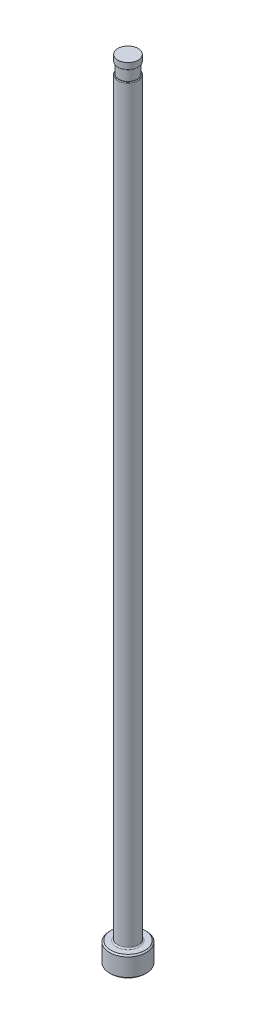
ISO-10303-21;
HEADER;
FILE_DESCRIPTION(('STEP AP214'),'2;1');
FILE_NAME('part.step','',(''),(''),'','','');
FILE_SCHEMA(('AUTOMOTIVE_DESIGN { 1 0 10303 214 1 1 1 1 }'));
ENDSEC;
DATA;
#1=APPLICATION_CONTEXT('core data for automotive mechanical design processes');
#2=APPLICATION_PROTOCOL_DEFINITION('international standard','automotive_design',2000,#1);
#3=PRODUCT_CONTEXT('',#1,'mechanical');
#4=PRODUCT('Part','Part','',(#3));
#5=PRODUCT_RELATED_PRODUCT_CATEGORY('part','',(#4));
#6=PRODUCT_DEFINITION_FORMATION('','',#4);
#7=PRODUCT_DEFINITION_CONTEXT('part definition',#1,'design');
#8=PRODUCT_DEFINITION('design','',#6,#7);
#9=PRODUCT_DEFINITION_SHAPE('','',#8);
#10=(LENGTH_UNIT() NAMED_UNIT(*) SI_UNIT(.MILLI.,.METRE.));
#11=(NAMED_UNIT(*) PLANE_ANGLE_UNIT() SI_UNIT($,.RADIAN.));
#12=(NAMED_UNIT(*) SI_UNIT($,.STERADIAN.) SOLID_ANGLE_UNIT());
#13=UNCERTAINTY_MEASURE_WITH_UNIT(LENGTH_MEASURE(1.E-05),#10,'distance_accuracy_value','');
#14=(GEOMETRIC_REPRESENTATION_CONTEXT(3) GLOBAL_UNCERTAINTY_ASSIGNED_CONTEXT((#13)) GLOBAL_UNIT_ASSIGNED_CONTEXT((#10,
#11,#12)) REPRESENTATION_CONTEXT('',''));
#15=CARTESIAN_POINT('',(0.,0.,0.));
#16=DIRECTION('',(0.,0.,1.));
#17=DIRECTION('',(1.,0.,0.));
#18=AXIS2_PLACEMENT_3D('',#15,#16,#17);
#19=CARTESIAN_POINT('',(-1.98373999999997,151.13,0.));
#20=DIRECTION('',(0.,1.,0.));
#21=DIRECTION('',(0.,0.,1.));
#22=AXIS2_PLACEMENT_3D('',#19,#20,#21);
#23=PLANE('',#22);
#24=CARTESIAN_POINT('',(0.,151.13,0.));
#25=DIRECTION('',(0.,1.,0.));
#26=DIRECTION('',(0.,0.,1.));
#27=AXIS2_PLACEMENT_3D('',#24,#25,#26);
#28=CIRCLE('',#27,1.83768999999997);
#29=CARTESIAN_POINT('',(0.,151.13,1.83768999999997));
#30=VERTEX_POINT('',#29);
#31=EDGE_CURVE('E11',#30,#30,#28,.F.);
#32=ORIENTED_EDGE('',*,*,#31,.T.);
#33=EDGE_LOOP('',(#32));
#34=FACE_BOUND('',#33,.T.);
#35=CARTESIAN_POINT('',(0.,151.13,0.));
#36=DIRECTION('',(0.,1.,0.));
#37=DIRECTION('',(0.,0.,1.));
#38=AXIS2_PLACEMENT_3D('',#35,#36,#37);
#39=CIRCLE('',#38,1.78053999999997);
#40=CARTESIAN_POINT('',(0.,151.13,1.78053999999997));
#41=VERTEX_POINT('',#40);
#42=EDGE_CURVE('E78',#41,#41,#39,.T.);
#43=ORIENTED_EDGE('',*,*,#42,.T.);
#44=EDGE_LOOP('',(#43));
#45=FACE_BOUND('',#44,.T.);
#46=ADVANCED_FACE('F36',(#34,#45),#23,.F.);
#47=CARTESIAN_POINT('',(0.,259.958771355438,0.));
#48=DIRECTION('',(0.,1.,0.));
#49=DIRECTION('',(0.,0.,1.));
#50=AXIS2_PLACEMENT_3D('',#47,#48,#49);
#51=CYLINDRICAL_SURFACE('',#50,1.98373999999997);
#52=DIRECTION('',(0.,1.,0.));
#53=VECTOR('',#52,1.);
#54=CARTESIAN_POINT('',(-1.78053999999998,259.958771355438,-0.87458658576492));
#55=LINE('',#54,#53);
#56=CARTESIAN_POINT('',(-1.78053999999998,148.971,-0.87458658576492));
#57=VERTEX_POINT('',#56);
#58=CARTESIAN_POINT('',(-1.78053999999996,86.614,-0.874586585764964));
#59=VERTEX_POINT('',#58);
#60=EDGE_CURVE('E73',#57,#59,#55,.F.);
#61=ORIENTED_EDGE('',*,*,#60,.F.);
#62=CARTESIAN_POINT('',(0.,148.971,0.));
#63=DIRECTION('',(0.,-1.,0.));
#64=DIRECTION('',(0.,0.,-1.));
#65=AXIS2_PLACEMENT_3D('',#62,#63,#64);
#66=CIRCLE('',#65,1.98373999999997);
#67=CARTESIAN_POINT('',(-1.78053999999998,148.971,0.87458658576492));
#68=VERTEX_POINT('',#67);
#69=EDGE_CURVE('E51',#57,#68,#66,.T.);
#70=ORIENTED_EDGE('',*,*,#69,.T.);
#71=DIRECTION('',(0.,1.,0.));
#72=VECTOR('',#71,1.);
#73=CARTESIAN_POINT('',(-1.78053999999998,259.958771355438,0.87458658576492));
#74=LINE('',#73,#72);
#75=CARTESIAN_POINT('',(-1.78053999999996,86.614,0.874586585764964));
#76=VERTEX_POINT('',#75);
#77=EDGE_CURVE('E84',#76,#68,#74,.T.);
#78=ORIENTED_EDGE('',*,*,#77,.F.);
#79=CARTESIAN_POINT('',(-1.78053999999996,86.614,-0.874586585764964));
#80=CARTESIAN_POINT('',(-1.78053865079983,86.5812968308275,-0.874582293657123));
#81=CARTESIAN_POINT('',(-1.78104579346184,86.5486048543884,-0.873557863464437));
#82=CARTESIAN_POINT('',(-1.78306050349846,86.4833726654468,-0.869440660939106));
#83=CARTESIAN_POINT('',(-1.78456837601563,86.4508325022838,-0.866347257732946));
#84=CARTESIAN_POINT('',(-1.79058935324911,86.3533142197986,-0.853877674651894));
#85=CARTESIAN_POINT('',(-1.7965995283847,86.288794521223,-0.841311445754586));
#86=CARTESIAN_POINT('',(-1.81216655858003,86.162456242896,-0.807234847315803));
#87=CARTESIAN_POINT('',(-1.82173064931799,86.1006434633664,-0.785706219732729));
#88=CARTESIAN_POINT('',(-1.84353272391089,85.9818109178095,-0.733090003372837));
#89=CARTESIAN_POINT('',(-1.85576409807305,85.9247797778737,-0.702025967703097));
#90=CARTESIAN_POINT('',(-1.87864294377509,85.8296691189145,-0.637816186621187));
#91=CARTESIAN_POINT('',(-1.88904107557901,85.7901900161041,-0.606655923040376));
#92=CARTESIAN_POINT('',(-1.9096749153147,85.7169072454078,-0.538182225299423));
#93=CARTESIAN_POINT('',(-1.91991077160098,85.6830980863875,-0.500874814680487));
#94=CARTESIAN_POINT('',(-1.93765949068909,85.6272104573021,-0.426534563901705));
#95=CARTESIAN_POINT('',(-1.94535058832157,85.6041335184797,-0.390297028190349));
#96=CARTESIAN_POINT('',(-1.95906883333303,85.5641265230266,-0.314264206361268));
#97=CARTESIAN_POINT('',(-1.965096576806,85.5471942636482,-0.27447020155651));
#98=CARTESIAN_POINT('',(-1.97485334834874,85.5202257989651,-0.192104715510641));
#99=CARTESIAN_POINT('',(-1.97857112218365,85.5102233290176,-0.149520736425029));
#100=CARTESIAN_POINT('',(-1.98320696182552,85.497797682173,-0.0631103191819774));
#101=CARTESIAN_POINT('',(-1.98412600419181,85.4953718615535,-0.0192843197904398));
#102=CARTESIAN_POINT('',(-1.98310107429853,85.498100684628,0.0642372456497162));
#103=CARTESIAN_POINT('',(-1.98140057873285,85.5026106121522,0.103958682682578));
#104=CARTESIAN_POINT('',(-1.97575922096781,85.5178264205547,0.182020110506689));
#105=CARTESIAN_POINT('',(-1.97181856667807,85.5285317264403,0.220360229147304));
#106=CARTESIAN_POINT('',(-1.96206992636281,85.5557141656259,0.294827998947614));
#107=CARTESIAN_POINT('',(-1.95625507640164,85.5722125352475,0.330946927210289));
#108=CARTESIAN_POINT('',(-1.9432907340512,85.6103152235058,0.400107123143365));
#109=CARTESIAN_POINT('',(-1.93614084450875,85.6319210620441,0.433147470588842));
#110=CARTESIAN_POINT('',(-1.92029960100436,85.6819613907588,0.498934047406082));
#111=CARTESIAN_POINT('',(-1.91152531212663,85.7108706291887,0.531297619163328));
#112=CARTESIAN_POINT('',(-1.89377241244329,85.7730184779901,0.591469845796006));
#113=CARTESIAN_POINT('',(-1.88479370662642,85.8062591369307,0.619276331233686));
#114=CARTESIAN_POINT('',(-1.86569807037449,85.8823604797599,0.674838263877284));
#115=CARTESIAN_POINT('',(-1.85566100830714,85.9258824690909,0.701713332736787));
#116=CARTESIAN_POINT('',(-1.83693898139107,86.0164245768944,0.749356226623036));
#117=CARTESIAN_POINT('',(-1.82825528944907,86.0634479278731,0.770118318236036));
#118=CARTESIAN_POINT('',(-1.8111557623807,86.1701808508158,0.809629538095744));
#119=CARTESIAN_POINT('',(-1.8031876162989,86.2304653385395,0.827017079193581));
#120=CARTESIAN_POINT('',(-1.79067795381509,86.3530954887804,0.853764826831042));
#121=CARTESIAN_POINT('',(-1.78613494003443,86.4154402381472,0.863128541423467));
#122=CARTESIAN_POINT('',(-1.78247943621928,86.5007444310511,0.870628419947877));
#123=CARTESIAN_POINT('',(-1.78175210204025,86.5233874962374,0.872115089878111));
#124=CARTESIAN_POINT('',(-1.78078289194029,86.5686849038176,0.874092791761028));
#125=CARTESIAN_POINT('',(-1.78054010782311,86.5913391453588,0.874585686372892));
#126=CARTESIAN_POINT('',(-1.78053999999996,86.614,0.874586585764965));
#127=B_SPLINE_CURVE_WITH_KNOTS('',3,(#79,#80,#81,#82,#83,#84,#85,#86,#87,#88,#89,#90,#91,#92,
#93,#94,#95,#96,#97,#98,#99,#100,#101,#102,#103,#104,#105,#106,#107,#108,#109,#110,#111,#112,
#113,#114,#115,#116,#117,#118,#119,#120,#121,#122,#123,#124,#125,#126),.UNSPECIFIED.,.F.,.F.,(4,
2,2,2,2,2,2,2,2,2,2,2,2,2,2,2,2,2,2,2,2,2,2,4),(0.,0.098066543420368,0.196163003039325,
0.393415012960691,0.591070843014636,0.78824232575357,0.941736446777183,1.09508104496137,
1.22546509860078,1.35580236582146,1.48676976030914,1.6176914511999,1.73715752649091,
1.85661251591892,1.97651005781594,2.0964433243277,2.22876073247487,2.36114094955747,
2.51695507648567,2.67291488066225,2.86196277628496,3.05092797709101,3.11901829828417,
3.18698087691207),.UNSPECIFIED.);
#128=EDGE_CURVE('E81',#59,#76,#127,.T.);
#129=ORIENTED_EDGE('',*,*,#128,.F.);
#130=EDGE_LOOP('',(#61,#70,#78,#129));
#131=FACE_BOUND('',#130,.T.);
#132=CARTESIAN_POINT('',(0.,4.21640000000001,0.));
#133=DIRECTION('',(0.,1.,0.));
#134=DIRECTION('',(0.,0.,1.));
#135=AXIS2_PLACEMENT_3D('',#132,#133,#134);
#136=CIRCLE('',#135,1.98373999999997);
#137=CARTESIAN_POINT('',(0.,4.21640000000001,1.98373999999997));
#138=VERTEX_POINT('',#137);
#139=EDGE_CURVE('E116',#138,#138,#136,.T.);
#140=ORIENTED_EDGE('',*,*,#139,.T.);
#141=EDGE_LOOP('',(#140));
#142=FACE_BOUND('',#141,.T.);
#143=ADVANCED_FACE('F82',(#131,#142),#51,.T.);
#144=CARTESIAN_POINT('',(0.,0.,0.));
#145=DIRECTION('',(0.,-1.,0.));
#146=DIRECTION('',(0.,0.,-1.));
#147=AXIS2_PLACEMENT_3D('',#144,#145,#146);
#148=PLANE('',#147);
#149=CARTESIAN_POINT('',(0.,0.,0.));
#150=DIRECTION('',(0.,-1.,0.));
#151=DIRECTION('',(0.,0.,-1.));
#152=AXIS2_PLACEMENT_3D('',#149,#150,#151);
#153=CIRCLE('',#152,3.31469999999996);
#154=CARTESIAN_POINT('',(0.,0.,-3.31469999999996));
#155=VERTEX_POINT('',#154);
#156=EDGE_CURVE('E113',#155,#155,#153,.T.);
#157=ORIENTED_EDGE('',*,*,#156,.T.);
#158=EDGE_LOOP('',(#157));
#159=FACE_BOUND('',#158,.T.);
#160=ADVANCED_FACE('F192',(#159),#148,.T.);
#161=CARTESIAN_POINT('',(0.,259.958771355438,0.));
#162=DIRECTION('',(0.,1.,0.));
#163=DIRECTION('',(0.,0.,1.));
#164=AXIS2_PLACEMENT_3D('',#161,#162,#163);
#165=CYLINDRICAL_SURFACE('',#164,3.56869999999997);
#166=CARTESIAN_POINT('',(0.,3.70839999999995,0.));
#167=DIRECTION('',(0.,1.,0.));
#168=DIRECTION('',(0.,0.,1.));
#169=AXIS2_PLACEMENT_3D('',#166,#167,#168);
#170=CIRCLE('',#169,3.56869999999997);
#171=CARTESIAN_POINT('',(0.,3.70839999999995,3.56869999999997));
#172=VERTEX_POINT('',#171);
#173=EDGE_CURVE('E110',#172,#172,#170,.F.);
#174=ORIENTED_EDGE('',*,*,#173,.T.);
#175=EDGE_LOOP('',(#174));
#176=FACE_BOUND('',#175,.T.);
#177=CARTESIAN_POINT('',(0.,0.254000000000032,0.));
#178=DIRECTION('',(0.,-1.,0.));
#179=DIRECTION('',(0.,0.,-1.));
#180=AXIS2_PLACEMENT_3D('',#177,#178,#179);
#181=CIRCLE('',#180,3.56869999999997);
#182=CARTESIAN_POINT('',(0.,0.254000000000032,-3.56869999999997));
#183=VERTEX_POINT('',#182);
#184=EDGE_CURVE('E107',#183,#183,#181,.F.);
#185=ORIENTED_EDGE('',*,*,#184,.T.);
#186=EDGE_LOOP('',(#185));
#187=FACE_BOUND('',#186,.T.);
#188=ADVANCED_FACE('F195',(#176,#187),#165,.T.);
#189=CARTESIAN_POINT('',(-3.56869999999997,3.9624,0.));
#190=DIRECTION('',(0.,1.,0.));
#191=DIRECTION('',(0.,0.,1.));
#192=AXIS2_PLACEMENT_3D('',#189,#190,#191);
#193=PLANE('',#192);
#194=CARTESIAN_POINT('',(0.,3.9624,0.));
#195=DIRECTION('',(0.,1.,0.));
#196=DIRECTION('',(0.,0.,1.));
#197=AXIS2_PLACEMENT_3D('',#194,#195,#196);
#198=CIRCLE('',#197,2.23773999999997);
#199=CARTESIAN_POINT('',(0.,3.9624,2.23773999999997));
#200=VERTEX_POINT('',#199);
#201=EDGE_CURVE('E87',#200,#200,#198,.F.);
#202=ORIENTED_EDGE('',*,*,#201,.T.);
#203=EDGE_LOOP('',(#202));
#204=FACE_BOUND('',#203,.T.);
#205=CARTESIAN_POINT('',(0.,3.9624,0.));
#206=DIRECTION('',(0.,1.,0.));
#207=DIRECTION('',(0.,0.,1.));
#208=AXIS2_PLACEMENT_3D('',#205,#206,#207);
#209=CIRCLE('',#208,3.31469999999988);
#210=CARTESIAN_POINT('',(0.,3.9624,3.31469999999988));
#211=VERTEX_POINT('',#210);
#212=EDGE_CURVE('E104',#211,#211,#209,.T.);
#213=ORIENTED_EDGE('',*,*,#212,.T.);
#214=EDGE_LOOP('',(#213));
#215=FACE_BOUND('',#214,.T.);
#216=ADVANCED_FACE('F190',(#204,#215),#193,.T.);
#217=CARTESIAN_POINT('',(0.,3.96239999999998,0.));
#218=DIRECTION('',(0.,-1.,0.));
#219=DIRECTION('',(0.,0.,-1.));
#220=AXIS2_PLACEMENT_3D('',#217,#218,#219);
#221=CONICAL_SURFACE('',#220,3.31469999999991,0.785398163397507);
#222=ORIENTED_EDGE('',*,*,#173,.F.);
#223=EDGE_LOOP('',(#222));
#224=FACE_BOUND('',#223,.T.);
#225=ORIENTED_EDGE('',*,*,#212,.F.);
#226=EDGE_LOOP('',(#225));
#227=FACE_BOUND('',#226,.T.);
#228=ADVANCED_FACE('F186',(#224,#227),#221,.T.);
#229=CARTESIAN_POINT('',(0.,0.254000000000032,0.));
#230=DIRECTION('',(0.,1.,0.));
#231=DIRECTION('',(0.,0.,1.));
#232=AXIS2_PLACEMENT_3D('',#229,#230,#231);
#233=CONICAL_SURFACE('',#232,3.56869999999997,0.785398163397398);
#234=ORIENTED_EDGE('',*,*,#156,.F.);
#235=EDGE_LOOP('',(#234));
#236=FACE_BOUND('',#235,.T.);
#237=ORIENTED_EDGE('',*,*,#184,.F.);
#238=EDGE_LOOP('',(#237));
#239=FACE_BOUND('',#238,.T.);
#240=ADVANCED_FACE('F182',(#236,#239),#233,.T.);
#241=CARTESIAN_POINT('',(0.,4.21640000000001,0.));
#242=DIRECTION('',(0.,1.,0.));
#243=DIRECTION('',(0.,0.,1.));
#244=AXIS2_PLACEMENT_3D('',#241,#242,#243);
#245=TOROIDAL_SURFACE('',#244,2.23773999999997,0.254);
#246=ORIENTED_EDGE('',*,*,#201,.F.);
#247=EDGE_LOOP('',(#246));
#248=FACE_BOUND('',#247,.T.);
#249=ORIENTED_EDGE('',*,*,#139,.F.);
#250=EDGE_LOOP('',(#249));
#251=FACE_BOUND('',#250,.T.);
#252=ADVANCED_FACE('F147',(#248,#251),#245,.F.);
#253=CARTESIAN_POINT('',(-1.98373999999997,149.098,0.));
#254=DIRECTION('',(0.,-1.,0.));
#255=DIRECTION('',(0.,0.,-1.));
#256=AXIS2_PLACEMENT_3D('',#253,#254,#255);
#257=PLANE('',#256);
#258=DIRECTION('',(0.,0.,1.));
#259=VECTOR('',#258,1.);
#260=CARTESIAN_POINT('',(-1.78053999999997,149.098,0.));
#261=LINE('',#260,#259);
#262=CARTESIAN_POINT('',(-1.78053999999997,149.098,0.));
#263=VERTEX_POINT('',#262);
#264=CARTESIAN_POINT('',(-1.78053999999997,149.098,0.526460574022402));
#265=VERTEX_POINT('',#264);
#266=EDGE_CURVE('E90',#263,#265,#261,.T.);
#267=ORIENTED_EDGE('',*,*,#266,.T.);
#268=CARTESIAN_POINT('',(0.,149.098,0.));
#269=DIRECTION('',(0.,-1.,0.));
#270=DIRECTION('',(0.,0.,-1.));
#271=AXIS2_PLACEMENT_3D('',#268,#269,#270);
#272=CIRCLE('',#271,1.85673999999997);
#273=CARTESIAN_POINT('',(-1.78053999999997,149.098,-0.526460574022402));
#274=VERTEX_POINT('',#273);
#275=EDGE_CURVE('E86',#265,#274,#272,.F.);
#276=ORIENTED_EDGE('',*,*,#275,.T.);
#277=EDGE_CURVE('E79',#274,#263,#261,.T.);
#278=ORIENTED_EDGE('',*,*,#277,.T.);
#279=CARTESIAN_POINT('',(0.,149.098,0.));
#280=DIRECTION('',(0.,1.,0.));
#281=DIRECTION('',(0.,0.,1.));
#282=AXIS2_PLACEMENT_3D('',#279,#280,#281);
#283=CIRCLE('',#282,1.78053999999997);
#284=EDGE_CURVE('E101',#263,#263,#283,.T.);
#285=ORIENTED_EDGE('',*,*,#284,.F.);
#286=EDGE_LOOP('',(#267,#276,#278,#285));
#287=FACE_BOUND('',#286,.T.);
#288=ADVANCED_FACE('F144',(#287),#257,.F.);
#289=CARTESIAN_POINT('',(0.,153.448281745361,0.));
#290=DIRECTION('',(0.,1.,0.));
#291=DIRECTION('',(0.,0.,1.));
#292=AXIS2_PLACEMENT_3D('',#289,#290,#291);
#293=CYLINDRICAL_SURFACE('',#292,1.78053999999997);
#294=ORIENTED_EDGE('',*,*,#42,.F.);
#295=EDGE_LOOP('',(#294));
#296=FACE_BOUND('',#295,.T.);
#297=ORIENTED_EDGE('',*,*,#284,.T.);
#298=EDGE_LOOP('',(#297));
#299=FACE_BOUND('',#298,.T.);
#300=ADVANCED_FACE('F141',(#296,#299),#293,.T.);
#301=CARTESIAN_POINT('',(-1.78053999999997,150.114,-3.56869999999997));
#302=DIRECTION('',(1.,0.,0.));
#303=DIRECTION('',(0.,1.,0.));
#304=AXIS2_PLACEMENT_3D('',#301,#302,#303);
#305=PLANE('',#304);
#306=ORIENTED_EDGE('',*,*,#277,.F.);
#307=CARTESIAN_POINT('',(-1.78053999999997,149.098,-0.526460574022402));
#308=CARTESIAN_POINT('',(-1.78053999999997,149.097978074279,-0.547390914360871));
#309=CARTESIAN_POINT('',(-1.78053999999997,149.09758039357,-0.568347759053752));
#310=CARTESIAN_POINT('',(-1.78053999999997,149.095614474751,-0.61048753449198));
#311=CARTESIAN_POINT('',(-1.78053999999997,149.094030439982,-0.631669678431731));
#312=CARTESIAN_POINT('',(-1.78053999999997,149.089173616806,-0.674541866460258));
#313=CARTESIAN_POINT('',(-1.78053999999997,149.085847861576,-0.696226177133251));
#314=CARTESIAN_POINT('',(-1.78053999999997,149.076728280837,-0.739006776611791));
#315=CARTESIAN_POINT('',(-1.78053999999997,149.070950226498,-0.760105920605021));
#316=CARTESIAN_POINT('',(-1.78053999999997,149.060654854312,-0.787147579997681));
#317=CARTESIAN_POINT('',(-1.78053999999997,149.057896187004,-0.793754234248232));
#318=CARTESIAN_POINT('',(-1.78053999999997,149.051851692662,-0.806726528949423));
#319=CARTESIAN_POINT('',(-1.78053999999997,149.048565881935,-0.813092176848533));
#320=CARTESIAN_POINT('',(-1.78053999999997,149.041320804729,-0.825509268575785));
#321=CARTESIAN_POINT('',(-1.78053999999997,149.037355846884,-0.831557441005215));
#322=CARTESIAN_POINT('',(-1.78053999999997,149.02861692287,-0.843040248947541));
#323=CARTESIAN_POINT('',(-1.78053999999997,149.023845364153,-0.84847663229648));
#324=CARTESIAN_POINT('',(-1.78053999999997,149.015648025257,-0.856139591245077));
#325=CARTESIAN_POINT('',(-1.78053999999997,149.012558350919,-0.858723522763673));
#326=CARTESIAN_POINT('',(-1.78053999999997,149.006050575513,-0.863452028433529));
#327=CARTESIAN_POINT('',(-1.78053999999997,149.002632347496,-0.865596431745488));
#328=CARTESIAN_POINT('',(-1.78053999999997,148.995433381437,-0.869319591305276));
#329=CARTESIAN_POINT('',(-1.78053999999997,148.991648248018,-0.870890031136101));
#330=CARTESIAN_POINT('',(-1.78053999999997,148.983845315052,-0.873246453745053));
#331=CARTESIAN_POINT('',(-1.78053999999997,148.979828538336,-0.874035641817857));
#332=CARTESIAN_POINT('',(-1.78053999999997,148.974987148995,-0.874450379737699));
#333=CARTESIAN_POINT('',(-1.78053999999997,148.97419041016,-0.874501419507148));
#334=CARTESIAN_POINT('',(-1.78053999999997,148.972595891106,-0.874569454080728));
#335=CARTESIAN_POINT('',(-1.78053999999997,148.971798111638,-0.874586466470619));
#336=CARTESIAN_POINT('',(-1.78053999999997,148.971,-0.874586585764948));
#337=B_SPLINE_CURVE_WITH_KNOTS('',3,(#307,#308,#309,#310,#311,#312,#313,#314,#315,#316,#317,
#318,#319,#320,#321,#322,#323,#324,#325,#326,#327,#328,#329,#330,#331,#332,#333,#334,#335,#336),
.UNSPECIFIED.,.F.,.F.,(4,2,2,2,2,2,2,2,2,2,2,2,2,2,4),(0.,0.0628307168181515,0.126513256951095,
0.192255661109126,0.257581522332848,0.279042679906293,0.300503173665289,0.322153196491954,
0.343739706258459,0.355794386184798,0.367853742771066,0.380081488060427,0.392258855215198,
0.394653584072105,0.397047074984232),.UNSPECIFIED.);
#338=EDGE_CURVE('E59',#274,#57,#337,.T.);
#339=ORIENTED_EDGE('',*,*,#338,.T.);
#340=ORIENTED_EDGE('',*,*,#60,.T.);
#341=DIRECTION('',(0.,0.,1.));
#342=VECTOR('',#341,1.);
#343=CARTESIAN_POINT('',(-1.78053999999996,86.614,-3.56869999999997));
#344=LINE('',#343,#342);
#345=EDGE_CURVE('E77',#59,#76,#344,.T.);
#346=ORIENTED_EDGE('',*,*,#345,.T.);
#347=ORIENTED_EDGE('',*,*,#77,.T.);
#348=CARTESIAN_POINT('',(-1.78053999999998,148.971,0.87458658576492));
#349=CARTESIAN_POINT('',(-1.78053999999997,148.974428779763,0.874595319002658));
#350=CARTESIAN_POINT('',(-1.78053999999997,148.97784637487,0.87427209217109));
#351=CARTESIAN_POINT('',(-1.78053999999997,148.984538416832,0.873041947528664));
#352=CARTESIAN_POINT('',(-1.78053999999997,148.987814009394,0.872141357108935));
#353=CARTESIAN_POINT('',(-1.78053999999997,148.994906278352,0.869569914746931));
#354=CARTESIAN_POINT('',(-1.78053999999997,148.998675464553,0.867770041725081));
#355=CARTESIAN_POINT('',(-1.78053999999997,149.005882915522,0.863582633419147));
#356=CARTESIAN_POINT('',(-1.78053999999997,149.009319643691,0.861192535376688));
#357=CARTESIAN_POINT('',(-1.78053999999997,149.017682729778,0.854521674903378));
#358=CARTESIAN_POINT('',(-1.78053999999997,149.022361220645,0.849933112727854));
#359=CARTESIAN_POINT('',(-1.78053999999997,149.030984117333,0.840123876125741));
#360=CARTESIAN_POINT('',(-1.78053999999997,149.034927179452,0.834902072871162));
#361=CARTESIAN_POINT('',(-1.78053999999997,149.045616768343,0.819005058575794));
#362=CARTESIAN_POINT('',(-1.78053999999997,149.051546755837,0.807787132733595));
#363=CARTESIAN_POINT('',(-1.78053999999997,149.061885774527,0.784614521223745));
#364=CARTESIAN_POINT('',(-1.78053999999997,149.066281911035,0.77265454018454));
#365=CARTESIAN_POINT('',(-1.78053999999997,149.076197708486,0.741171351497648));
#366=CARTESIAN_POINT('',(-1.78053999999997,149.080834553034,0.721373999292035));
#367=CARTESIAN_POINT('',(-1.78053999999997,149.088183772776,0.681384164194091));
#368=CARTESIAN_POINT('',(-1.78053999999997,149.090888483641,0.661190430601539));
#369=CARTESIAN_POINT('',(-1.78053999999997,149.094786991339,0.621840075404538));
#370=CARTESIAN_POINT('',(-1.78053999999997,149.096058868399,0.602690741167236));
#371=CARTESIAN_POINT('',(-1.78053999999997,149.097654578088,0.56450905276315));
#372=CARTESIAN_POINT('',(-1.78053999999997,149.097986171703,0.545477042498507));
#373=CARTESIAN_POINT('',(-1.78053999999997,149.098,0.526460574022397));
#374=B_SPLINE_CURVE_WITH_KNOTS('',3,(#348,#349,#350,#351,#352,#353,#354,#355,#356,#357,#358,
#359,#360,#361,#362,#363,#364,#365,#366,#367,#368,#369,#370,#371,#372,#373),.UNSPECIFIED.,.F.,
.F.,(4,2,2,2,2,2,2,2,2,2,2,2,4),(0.,0.0102530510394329,0.0203956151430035,0.0328568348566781,
0.045373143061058,0.064921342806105,0.0845049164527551,0.122359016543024,0.160524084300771,
0.221350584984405,0.282417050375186,0.339964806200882,0.397036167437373),.UNSPECIFIED.);
#375=EDGE_CURVE('E172',#68,#265,#374,.T.);
#376=ORIENTED_EDGE('',*,*,#375,.T.);
#377=ORIENTED_EDGE('',*,*,#266,.F.);
#378=EDGE_LOOP('',(#306,#339,#340,#346,#347,#376,#377));
#379=FACE_BOUND('',#378,.T.);
#380=ADVANCED_FACE('F75',(#379),#305,.F.);
#381=CARTESIAN_POINT('',(-4.95553999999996,86.614,-3.56869999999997));
#382=DIRECTION('',(0.,0.,1.));
#383=DIRECTION('',(1.,0.,0.));
#384=AXIS2_PLACEMENT_3D('',#381,#382,#383);
#385=CYLINDRICAL_SURFACE('',#384,3.175);
#386=ORIENTED_EDGE('',*,*,#345,.F.);
#387=ORIENTED_EDGE('',*,*,#128,.T.);
#388=EDGE_LOOP('',(#386,#387));
#389=FACE_BOUND('',#388,.T.);
#390=ADVANCED_FACE('F89',(#389),#385,.F.);
#391=CARTESIAN_POINT('',(0.,152.687735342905,0.));
#392=DIRECTION('',(0.,1.,0.));
#393=DIRECTION('',(0.,0.,1.));
#394=AXIS2_PLACEMENT_3D('',#391,#392,#393);
#395=CYLINDRICAL_SURFACE('',#394,1.96468999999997);
#396=CARTESIAN_POINT('',(0.,151.257,0.));
#397=DIRECTION('',(0.,1.,0.));
#398=DIRECTION('',(0.,0.,1.));
#399=AXIS2_PLACEMENT_3D('',#396,#397,#398);
#400=CIRCLE('',#399,1.96468999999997);
#401=CARTESIAN_POINT('',(0.,151.257,1.96468999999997));
#402=VERTEX_POINT('',#401);
#403=EDGE_CURVE('E44',#402,#402,#400,.T.);
#404=ORIENTED_EDGE('',*,*,#403,.T.);
#405=EDGE_LOOP('',(#404));
#406=FACE_BOUND('',#405,.T.);
#407=CARTESIAN_POINT('',(0.,152.4,0.));
#408=DIRECTION('',(0.,1.,0.));
#409=DIRECTION('',(0.,0.,1.));
#410=AXIS2_PLACEMENT_3D('',#407,#408,#409);
#411=CIRCLE('',#410,1.96468999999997);
#412=CARTESIAN_POINT('',(0.,152.4,1.96468999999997));
#413=VERTEX_POINT('',#412);
#414=EDGE_CURVE('E91',#413,#413,#411,.T.);
#415=ORIENTED_EDGE('',*,*,#414,.F.);
#416=EDGE_LOOP('',(#415));
#417=FACE_BOUND('',#416,.T.);
#418=ADVANCED_FACE('F135',(#406,#417),#395,.T.);
#419=CARTESIAN_POINT('',(-1.98373999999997,152.4,0.));
#420=DIRECTION('',(0.,1.,0.));
#421=DIRECTION('',(0.,0.,1.));
#422=AXIS2_PLACEMENT_3D('',#419,#420,#421);
#423=PLANE('',#422);
#424=ORIENTED_EDGE('',*,*,#414,.T.);
#425=EDGE_LOOP('',(#424));
#426=FACE_BOUND('',#425,.T.);
#427=ADVANCED_FACE('F149',(#426),#423,.T.);
#428=CARTESIAN_POINT('',(0.,148.971,0.));
#429=DIRECTION('',(0.,-1.,0.));
#430=DIRECTION('',(0.,0.,-1.));
#431=AXIS2_PLACEMENT_3D('',#428,#429,#430);
#432=TOROIDAL_SURFACE('',#431,1.85673999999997,0.127);
#433=ORIENTED_EDGE('',*,*,#375,.F.);
#434=ORIENTED_EDGE('',*,*,#69,.F.);
#435=ORIENTED_EDGE('',*,*,#338,.F.);
#436=ORIENTED_EDGE('',*,*,#275,.F.);
#437=EDGE_LOOP('',(#433,#434,#435,#436));
#438=FACE_BOUND('',#437,.T.);
#439=ADVANCED_FACE('F151',(#438),#432,.T.);
#440=CARTESIAN_POINT('',(0.,151.257,0.));
#441=DIRECTION('',(0.,1.,0.));
#442=DIRECTION('',(0.,0.,1.));
#443=AXIS2_PLACEMENT_3D('',#440,#441,#442);
#444=TOROIDAL_SURFACE('',#443,1.83768999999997,0.127);
#445=ORIENTED_EDGE('',*,*,#31,.F.);
#446=EDGE_LOOP('',(#445));
#447=FACE_BOUND('',#446,.T.);
#448=ORIENTED_EDGE('',*,*,#403,.F.);
#449=EDGE_LOOP('',(#448));
#450=FACE_BOUND('',#449,.T.);
#451=ADVANCED_FACE('F38',(#447,#450),#444,.T.);
#452=CLOSED_SHELL('',(#46,#143,#160,#188,#216,#228,#240,#252,#288,#300,#380,#390,#418,#427,#439,#451));
#453=MANIFOLD_SOLID_BREP('B2',#452);
#454=ADVANCED_BREP_SHAPE_REPRESENTATION('',(#18,#453),#14);
#455=SHAPE_DEFINITION_REPRESENTATION(#9,#454);
ENDSEC;
END-ISO-10303-21;
